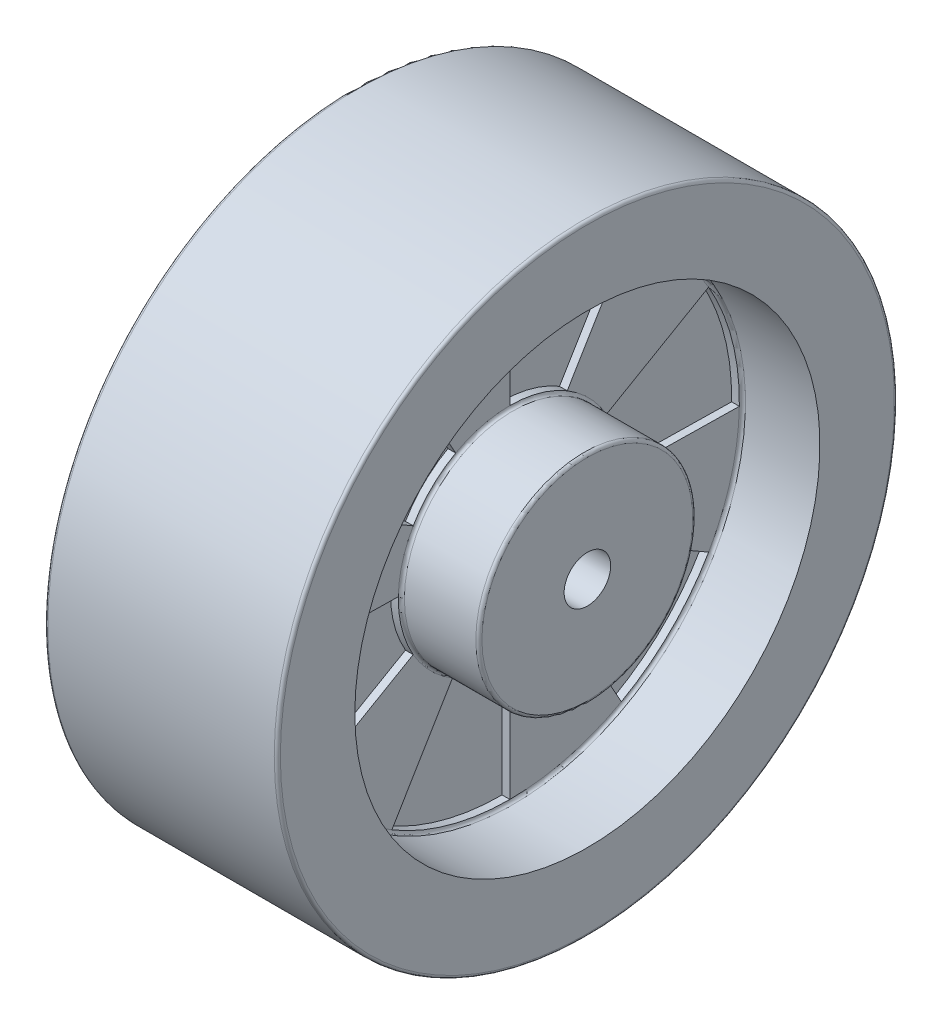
from build123d import *

# Parameters (mm, degrees)
FILLET1_R            = 1
CUT_EXTRUDE1_DEPTH   = 2.54
CIRPATTERN1_COUNT    = 6
MIRROR1_COPY_1_DEPTH = 2.54
MIRROR1_COPY_2_DEPTH = 2.54
MIRROR1_COPY_3_DEPTH = 2.54
MIRROR1_COPY_4_DEPTH = 2.54
MIRROR1_COPY_5_DEPTH = 2.54


with BuildPart() as part:
    # Sketch1 → Revolve1 (revolve)
    with BuildSketch(Plane.XY, mode=Mode.PRIVATE) as revolve1_sk:
        Polygon((-38.1, 7.62), (38.1, 7.62), (38.1, 35.56), (12.7, 35.56), (12.7, 76.2), (38.1, 76.2), (38.1, 101.6), (-38.1, 101.6), (-38.1, 76.2), (-12.7, 76.2), (-12.7, 35.56), (-38.1, 35.56), align=None)
    revolve(revolve1_sk.sketch.rotate(Axis((0, 0, 0), (1, 0, 0)), 90), axis=Axis((0, 0, 0), (1, 0, 0)))

    # Fillet1
    fillet1_edges = [part.edges().sort_by_distance(p)[0] for p in [
        (-38.1, 0, -101.6),
        (38.1, 0, -101.6),
        (12.7, 0, -76.2),
        (12.7, 0, -35.56),
        (38.1, 0, -35.56),
        (-38.1, 0, -35.56),
        (-12.7, 0, -35.56),
        (-12.7, 0, -76.2),
    ]]
    fillet(fillet1_edges, radius=FILLET1_R)

    # Sketch2 → Cut-Extrude1 (cut)
    with BuildSketch(Plane(origin=(12.7, 0, 0), x_dir=(0, 0, -1), z_dir=(1, 0, 0))):
        with BuildLine():
            Line((0, 75.2), (0, 36.56))
            ThreePointArc((0, 36.56), (9.754400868, 35.234716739), (18.801616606, 31.35494878))
            Line((18.801616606, 31.35494878), (38.67290943, 64.493767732))
            ThreePointArc((38.67290943, 64.493767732), (20.063756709, 72.474034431), (0, 75.2))
        make_face()
    cut_extrude1 = extrude(amount=-CUT_EXTRUDE1_DEPTH, mode=Mode.SUBTRACT)

    # CirPattern1: Cut-Extrude1 ×6 about axis
    cirpattern1_axis = Axis((0, 0, 0), (1, 0, 0))
    for i in range(1, CIRPATTERN1_COUNT):
        add(cut_extrude1.rotate(cirpattern1_axis, i * 360 / CIRPATTERN1_COUNT), mode=Mode.SUBTRACT)

    # Mirror1: Cut-Extrude1 across plane
    add(cut_extrude1.mirror(Plane(origin=(0, 0, 0), x_dir=(0, 0, 1), z_dir=(1, 0, 0))), mode=Mode.SUBTRACT)

    # Mirror1 copy 1 sketch → Mirror1 copy 1 (cut)
    with BuildSketch(Plane(origin=(-12.7, 0, 0), x_dir=(0, 0.8660254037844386, -0.5000000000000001), z_dir=(-1, 0, 0))):
        with BuildLine():
            Line((0, -75.2), (0, -36.56))
            ThreePointArc((0, -36.56), (9.754400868, -35.234716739), (18.801616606, -31.35494878))
            Line((18.801616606, -31.35494878), (38.67290943, -64.493767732))
            ThreePointArc((38.67290943, -64.493767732), (20.063756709, -72.474034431), (0, -75.2))
        make_face()
    extrude(amount=-MIRROR1_COPY_1_DEPTH, mode=Mode.SUBTRACT)

    # Mirror1 copy 2 sketch → Mirror1 copy 2 (cut)
    with BuildSketch(Plane(origin=(-12.7, 0, 0), x_dir=(0, 0.8660254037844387, 0.4999999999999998), z_dir=(-1, 0, 0))):
        with BuildLine():
            Line((0, -75.2), (0, -36.56))
            ThreePointArc((0, -36.56), (9.754400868, -35.234716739), (18.801616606, -31.35494878))
            Line((18.801616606, -31.35494878), (38.67290943, -64.493767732))
            ThreePointArc((38.67290943, -64.493767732), (20.063756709, -72.474034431), (0, -75.2))
        make_face()
    extrude(amount=-MIRROR1_COPY_2_DEPTH, mode=Mode.SUBTRACT)

    # Mirror1 copy 3 sketch → Mirror1 copy 3 (cut)
    with BuildSketch(Plane.ZY.offset(12.7)):
        with BuildLine():
            Line((0, -75.2), (0, -36.56))
            ThreePointArc((0, -36.56), (9.754400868, -35.234716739), (18.801616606, -31.35494878))
            Line((18.801616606, -31.35494878), (38.67290943, -64.493767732))
            ThreePointArc((38.67290943, -64.493767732), (20.063756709, -72.474034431), (0, -75.2))
        make_face()
    extrude(amount=-MIRROR1_COPY_3_DEPTH, mode=Mode.SUBTRACT)

    # Mirror1 copy 4 sketch → Mirror1 copy 4 (cut)
    with BuildSketch(Plane(origin=(-12.7, 0, 0), x_dir=(0, -0.8660254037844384, 0.5000000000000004), z_dir=(-1, 0, 0))):
        with BuildLine():
            Line((0, -75.2), (0, -36.56))
            ThreePointArc((0, -36.56), (9.754400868, -35.234716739), (18.801616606, -31.35494878))
            Line((18.801616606, -31.35494878), (38.67290943, -64.493767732))
            ThreePointArc((38.67290943, -64.493767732), (20.063756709, -72.474034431), (0, -75.2))
        make_face()
    extrude(amount=-MIRROR1_COPY_4_DEPTH, mode=Mode.SUBTRACT)

    # Mirror1 copy 5 sketch → Mirror1 copy 5 (cut)
    with BuildSketch(Plane(origin=(-12.7, 0, 0), x_dir=(0, -0.8660254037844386, -0.5000000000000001), z_dir=(-1, 0, 0))):
        with BuildLine():
            Line((0, -75.2), (0, -36.56))
            ThreePointArc((0, -36.56), (9.754400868, -35.234716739), (18.801616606, -31.35494878))
            Line((18.801616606, -31.35494878), (38.67290943, -64.493767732))
            ThreePointArc((38.67290943, -64.493767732), (20.063756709, -72.474034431), (0, -75.2))
        make_face()
    extrude(amount=-MIRROR1_COPY_5_DEPTH, mode=Mode.SUBTRACT)


solid = part.part
